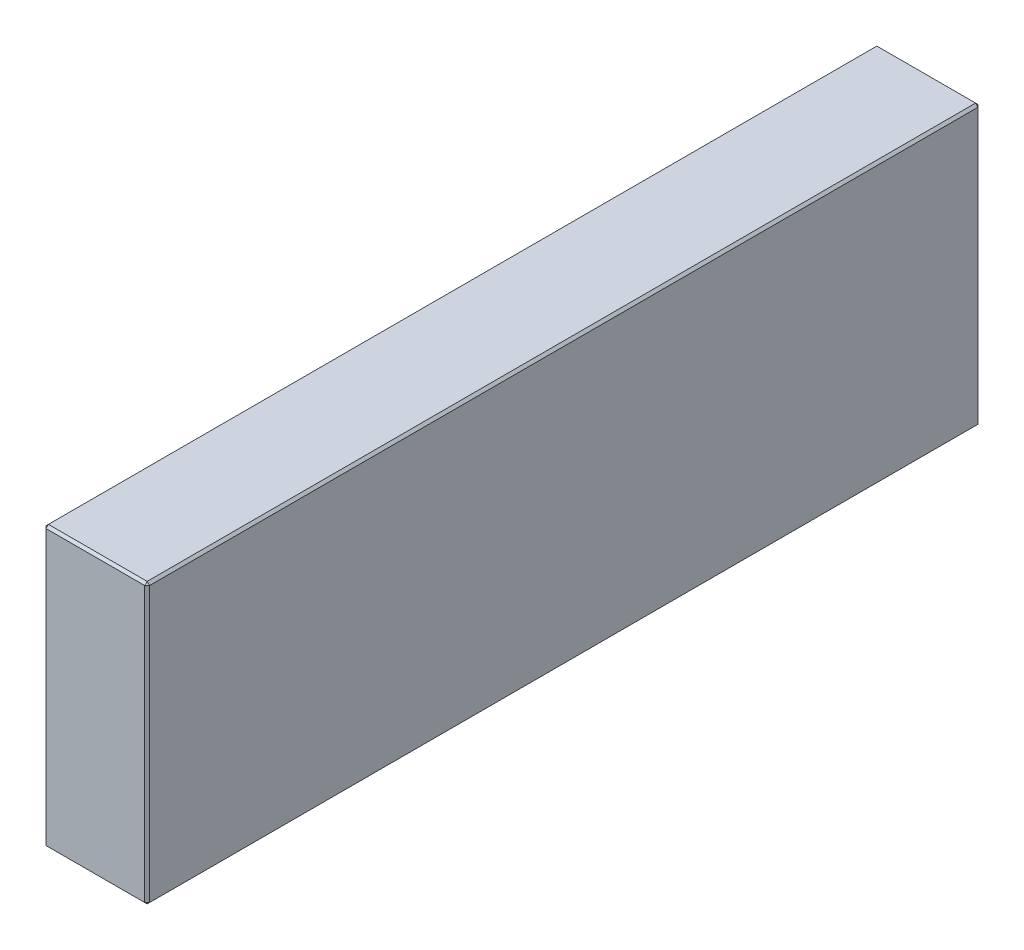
ISO-10303-21;
HEADER;
FILE_DESCRIPTION(('STEP AP214'),'2;1');
FILE_NAME('part.step','',(''),(''),'','','');
FILE_SCHEMA(('AUTOMOTIVE_DESIGN { 1 0 10303 214 1 1 1 1 }'));
ENDSEC;
DATA;
#1=APPLICATION_CONTEXT('core data for automotive mechanical design processes');
#2=APPLICATION_PROTOCOL_DEFINITION('international standard','automotive_design',2000,#1);
#3=PRODUCT_CONTEXT('',#1,'mechanical');
#4=PRODUCT('Part','Part','',(#3));
#5=PRODUCT_RELATED_PRODUCT_CATEGORY('part','',(#4));
#6=PRODUCT_DEFINITION_FORMATION('','',#4);
#7=PRODUCT_DEFINITION_CONTEXT('part definition',#1,'design');
#8=PRODUCT_DEFINITION('design','',#6,#7);
#9=PRODUCT_DEFINITION_SHAPE('','',#8);
#10=(LENGTH_UNIT() NAMED_UNIT(*) SI_UNIT(.MILLI.,.METRE.));
#11=(NAMED_UNIT(*) PLANE_ANGLE_UNIT() SI_UNIT($,.RADIAN.));
#12=(NAMED_UNIT(*) SI_UNIT($,.STERADIAN.) SOLID_ANGLE_UNIT());
#13=UNCERTAINTY_MEASURE_WITH_UNIT(LENGTH_MEASURE(1.E-05),#10,'distance_accuracy_value','');
#14=(GEOMETRIC_REPRESENTATION_CONTEXT(3) GLOBAL_UNCERTAINTY_ASSIGNED_CONTEXT((#13)) GLOBAL_UNIT_ASSIGNED_CONTEXT((#10,
#11,#12)) REPRESENTATION_CONTEXT('',''));
#15=CARTESIAN_POINT('',(0.,0.,0.));
#16=DIRECTION('',(0.,0.,1.));
#17=DIRECTION('',(1.,0.,0.));
#18=AXIS2_PLACEMENT_3D('',#15,#16,#17);
#19=CARTESIAN_POINT('',(-21.5,116.,173.));
#20=DIRECTION('',(1.,0.,0.));
#21=DIRECTION('',(0.,0.,-1.));
#22=AXIS2_PLACEMENT_3D('',#19,#20,#21);
#23=PLANE('',#22);
#24=DIRECTION('',(0.,-1.,0.));
#25=VECTOR('',#24,1.);
#26=CARTESIAN_POINT('',(-21.5,116.,-172.));
#27=LINE('',#26,#25);
#28=CARTESIAN_POINT('',(-21.5,115.,-172.));
#29=VERTEX_POINT('',#28);
#30=CARTESIAN_POINT('',(-21.5,1.,-172.));
#31=VERTEX_POINT('',#30);
#32=EDGE_CURVE('E114',#29,#31,#27,.T.);
#33=ORIENTED_EDGE('',*,*,#32,.T.);
#34=DIRECTION('',(0.,0.,1.));
#35=VECTOR('',#34,1.);
#36=CARTESIAN_POINT('',(-21.5,1.,173.));
#37=LINE('',#36,#35);
#38=CARTESIAN_POINT('',(-21.5,1.,172.));
#39=VERTEX_POINT('',#38);
#40=EDGE_CURVE('E110',#31,#39,#37,.T.);
#41=ORIENTED_EDGE('',*,*,#40,.T.);
#42=DIRECTION('',(0.,1.,0.));
#43=VECTOR('',#42,1.);
#44=CARTESIAN_POINT('',(-21.5,116.,172.));
#45=LINE('',#44,#43);
#46=CARTESIAN_POINT('',(-21.5,115.,172.));
#47=VERTEX_POINT('',#46);
#48=EDGE_CURVE('E103',#39,#47,#45,.T.);
#49=ORIENTED_EDGE('',*,*,#48,.T.);
#50=DIRECTION('',(0.,0.,-1.));
#51=VECTOR('',#50,1.);
#52=CARTESIAN_POINT('',(-21.5,115.,-173.));
#53=LINE('',#52,#51);
#54=EDGE_CURVE('E107',#47,#29,#53,.T.);
#55=ORIENTED_EDGE('',*,*,#54,.T.);
#56=EDGE_LOOP('',(#33,#41,#49,#55));
#57=FACE_BOUND('',#56,.T.);
#58=ADVANCED_FACE('F15',(#57),#23,.F.);
#59=CARTESIAN_POINT('',(21.5,116.,173.));
#60=DIRECTION('',(0.,0.,-1.));
#61=DIRECTION('',(-1.,0.,0.));
#62=AXIS2_PLACEMENT_3D('',#59,#60,#61);
#63=PLANE('',#62);
#64=DIRECTION('',(-1.,0.,0.));
#65=VECTOR('',#64,1.);
#66=CARTESIAN_POINT('',(-21.5,115.,173.));
#67=LINE('',#66,#65);
#68=CARTESIAN_POINT('',(20.5,115.,173.));
#69=VERTEX_POINT('',#68);
#70=CARTESIAN_POINT('',(-20.5,115.,173.));
#71=VERTEX_POINT('',#70);
#72=EDGE_CURVE('E164',#69,#71,#67,.T.);
#73=ORIENTED_EDGE('',*,*,#72,.T.);
#74=DIRECTION('',(0.,-1.,0.));
#75=VECTOR('',#74,1.);
#76=CARTESIAN_POINT('',(-20.5,116.,173.));
#77=LINE('',#76,#75);
#78=CARTESIAN_POINT('',(-20.5,1.,173.));
#79=VERTEX_POINT('',#78);
#80=EDGE_CURVE('E122',#71,#79,#77,.T.);
#81=ORIENTED_EDGE('',*,*,#80,.T.);
#82=DIRECTION('',(1.,0.,0.));
#83=VECTOR('',#82,1.);
#84=CARTESIAN_POINT('',(21.5,1.,173.));
#85=LINE('',#84,#83);
#86=CARTESIAN_POINT('',(20.5,1.,173.));
#87=VERTEX_POINT('',#86);
#88=EDGE_CURVE('E168',#79,#87,#85,.T.);
#89=ORIENTED_EDGE('',*,*,#88,.T.);
#90=DIRECTION('',(0.,1.,0.));
#91=VECTOR('',#90,1.);
#92=CARTESIAN_POINT('',(20.5,116.,173.));
#93=LINE('',#92,#91);
#94=EDGE_CURVE('E166',#87,#69,#93,.T.);
#95=ORIENTED_EDGE('',*,*,#94,.T.);
#96=EDGE_LOOP('',(#73,#81,#89,#95));
#97=FACE_BOUND('',#96,.T.);
#98=ADVANCED_FACE('F275',(#97),#63,.F.);
#99=CARTESIAN_POINT('',(21.5,116.,173.));
#100=DIRECTION('',(-1.,0.,0.));
#101=DIRECTION('',(0.,0.,1.));
#102=AXIS2_PLACEMENT_3D('',#99,#100,#101);
#103=PLANE('',#102);
#104=DIRECTION('',(0.,0.,-1.));
#105=VECTOR('',#104,1.);
#106=CARTESIAN_POINT('',(21.5,1.,173.));
#107=LINE('',#106,#105);
#108=CARTESIAN_POINT('',(21.5,1.,172.));
#109=VERTEX_POINT('',#108);
#110=CARTESIAN_POINT('',(21.5,1.,-172.));
#111=VERTEX_POINT('',#110);
#112=EDGE_CURVE('E159',#109,#111,#107,.T.);
#113=ORIENTED_EDGE('',*,*,#112,.T.);
#114=DIRECTION('',(0.,1.,0.));
#115=VECTOR('',#114,1.);
#116=CARTESIAN_POINT('',(21.5,116.,-172.));
#117=LINE('',#116,#115);
#118=CARTESIAN_POINT('',(21.5,115.,-172.));
#119=VERTEX_POINT('',#118);
#120=EDGE_CURVE('E161',#111,#119,#117,.T.);
#121=ORIENTED_EDGE('',*,*,#120,.T.);
#122=DIRECTION('',(0.,0.,1.));
#123=VECTOR('',#122,1.);
#124=CARTESIAN_POINT('',(21.5,115.,173.));
#125=LINE('',#124,#123);
#126=CARTESIAN_POINT('',(21.5,115.,172.));
#127=VERTEX_POINT('',#126);
#128=EDGE_CURVE('E155',#119,#127,#125,.T.);
#129=ORIENTED_EDGE('',*,*,#128,.T.);
#130=DIRECTION('',(0.,-1.,0.));
#131=VECTOR('',#130,1.);
#132=CARTESIAN_POINT('',(21.5,116.,172.));
#133=LINE('',#132,#131);
#134=EDGE_CURVE('E157',#127,#109,#133,.T.);
#135=ORIENTED_EDGE('',*,*,#134,.T.);
#136=EDGE_LOOP('',(#113,#121,#129,#135));
#137=FACE_BOUND('',#136,.T.);
#138=ADVANCED_FACE('F254',(#137),#103,.F.);
#139=CARTESIAN_POINT('',(21.5,116.,-173.));
#140=DIRECTION('',(0.,0.,1.));
#141=DIRECTION('',(1.,0.,0.));
#142=AXIS2_PLACEMENT_3D('',#139,#140,#141);
#143=PLANE('',#142);
#144=DIRECTION('',(0.,-1.,0.));
#145=VECTOR('',#144,1.);
#146=CARTESIAN_POINT('',(20.5,116.,-173.));
#147=LINE('',#146,#145);
#148=CARTESIAN_POINT('',(20.5,115.,-173.));
#149=VERTEX_POINT('',#148);
#150=CARTESIAN_POINT('',(20.5,1.,-173.));
#151=VERTEX_POINT('',#150);
#152=EDGE_CURVE('E148',#149,#151,#147,.T.);
#153=ORIENTED_EDGE('',*,*,#152,.T.);
#154=DIRECTION('',(-1.,0.,0.));
#155=VECTOR('',#154,1.);
#156=CARTESIAN_POINT('',(21.5,1.,-173.));
#157=LINE('',#156,#155);
#158=CARTESIAN_POINT('',(-20.5,1.,-173.));
#159=VERTEX_POINT('',#158);
#160=EDGE_CURVE('E153',#151,#159,#157,.T.);
#161=ORIENTED_EDGE('',*,*,#160,.T.);
#162=DIRECTION('',(0.,1.,0.));
#163=VECTOR('',#162,1.);
#164=CARTESIAN_POINT('',(-20.5,116.,-173.));
#165=LINE('',#164,#163);
#166=CARTESIAN_POINT('',(-20.5,115.,-173.));
#167=VERTEX_POINT('',#166);
#168=EDGE_CURVE('E150',#159,#167,#165,.T.);
#169=ORIENTED_EDGE('',*,*,#168,.T.);
#170=DIRECTION('',(1.,0.,0.));
#171=VECTOR('',#170,1.);
#172=CARTESIAN_POINT('',(21.5,115.,-173.));
#173=LINE('',#172,#171);
#174=EDGE_CURVE('E146',#167,#149,#173,.T.);
#175=ORIENTED_EDGE('',*,*,#174,.T.);
#176=EDGE_LOOP('',(#153,#161,#169,#175));
#177=FACE_BOUND('',#176,.T.);
#178=ADVANCED_FACE('F284',(#177),#143,.F.);
#179=CARTESIAN_POINT('',(0.,116.,0.));
#180=DIRECTION('',(0.,1.,0.));
#181=DIRECTION('',(0.,0.,1.));
#182=AXIS2_PLACEMENT_3D('',#179,#180,#181);
#183=PLANE('',#182);
#184=DIRECTION('',(0.,0.,-1.));
#185=VECTOR('',#184,1.);
#186=CARTESIAN_POINT('',(20.5,116.,-173.));
#187=LINE('',#186,#185);
#188=CARTESIAN_POINT('',(20.5,116.,172.));
#189=VERTEX_POINT('',#188);
#190=CARTESIAN_POINT('',(20.5,116.,-172.));
#191=VERTEX_POINT('',#190);
#192=EDGE_CURVE('E24',#189,#191,#187,.T.);
#193=ORIENTED_EDGE('',*,*,#192,.T.);
#194=DIRECTION('',(-1.,0.,0.));
#195=VECTOR('',#194,1.);
#196=CARTESIAN_POINT('',(-21.5,116.,-172.));
#197=LINE('',#196,#195);
#198=CARTESIAN_POINT('',(-20.5,116.,-172.));
#199=VERTEX_POINT('',#198);
#200=EDGE_CURVE('E9',#191,#199,#197,.T.);
#201=ORIENTED_EDGE('',*,*,#200,.T.);
#202=DIRECTION('',(0.,0.,1.));
#203=VECTOR('',#202,1.);
#204=CARTESIAN_POINT('',(-20.5,116.,173.));
#205=LINE('',#204,#203);
#206=CARTESIAN_POINT('',(-20.5,116.,172.));
#207=VERTEX_POINT('',#206);
#208=EDGE_CURVE('E180',#199,#207,#205,.T.);
#209=ORIENTED_EDGE('',*,*,#208,.T.);
#210=DIRECTION('',(1.,0.,0.));
#211=VECTOR('',#210,1.);
#212=CARTESIAN_POINT('',(21.5,116.,172.));
#213=LINE('',#212,#211);
#214=EDGE_CURVE('E35',#207,#189,#213,.T.);
#215=ORIENTED_EDGE('',*,*,#214,.T.);
#216=EDGE_LOOP('',(#193,#201,#209,#215));
#217=FACE_BOUND('',#216,.T.);
#218=ADVANCED_FACE('F350',(#217),#183,.T.);
#219=CARTESIAN_POINT('',(0.,0.,0.));
#220=DIRECTION('',(0.,1.,0.));
#221=DIRECTION('',(0.,0.,1.));
#222=AXIS2_PLACEMENT_3D('',#219,#220,#221);
#223=PLANE('',#222);
#224=DIRECTION('',(0.,0.,1.));
#225=VECTOR('',#224,1.);
#226=CARTESIAN_POINT('',(20.5,0.,0.));
#227=LINE('',#226,#225);
#228=CARTESIAN_POINT('',(20.5,0.,-172.));
#229=VERTEX_POINT('',#228);
#230=CARTESIAN_POINT('',(20.5,0.,172.));
#231=VERTEX_POINT('',#230);
#232=EDGE_CURVE('E171',#229,#231,#227,.T.);
#233=ORIENTED_EDGE('',*,*,#232,.T.);
#234=DIRECTION('',(-1.,0.,0.));
#235=VECTOR('',#234,1.);
#236=CARTESIAN_POINT('',(0.,0.,172.));
#237=LINE('',#236,#235);
#238=CARTESIAN_POINT('',(-20.5,0.,172.));
#239=VERTEX_POINT('',#238);
#240=EDGE_CURVE('E177',#231,#239,#237,.T.);
#241=ORIENTED_EDGE('',*,*,#240,.T.);
#242=DIRECTION('',(0.,0.,-1.));
#243=VECTOR('',#242,1.);
#244=CARTESIAN_POINT('',(-20.5,0.,0.));
#245=LINE('',#244,#243);
#246=CARTESIAN_POINT('',(-20.5,0.,-172.));
#247=VERTEX_POINT('',#246);
#248=EDGE_CURVE('E175',#239,#247,#245,.T.);
#249=ORIENTED_EDGE('',*,*,#248,.T.);
#250=DIRECTION('',(1.,0.,0.));
#251=VECTOR('',#250,1.);
#252=CARTESIAN_POINT('',(0.,0.,-172.));
#253=LINE('',#252,#251);
#254=EDGE_CURVE('E173',#247,#229,#253,.T.);
#255=ORIENTED_EDGE('',*,*,#254,.T.);
#256=EDGE_LOOP('',(#233,#241,#249,#255));
#257=FACE_BOUND('',#256,.T.);
#258=ADVANCED_FACE('F246',(#257),#223,.F.);
#259=CARTESIAN_POINT('',(21.5,116.,172.));
#260=DIRECTION('',(-0.707106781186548,0.,-0.707106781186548));
#261=DIRECTION('',(0.,-1.,0.));
#262=AXIS2_PLACEMENT_3D('',#259,#260,#261);
#263=PLANE('',#262);
#264=DIRECTION('',(-0.707106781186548,0.,0.707106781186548));
#265=VECTOR('',#264,1.);
#266=CARTESIAN_POINT('',(20.5,115.,173.));
#267=LINE('',#266,#265);
#268=EDGE_CURVE('E19',#69,#127,#267,.F.);
#269=ORIENTED_EDGE('',*,*,#268,.F.);
#270=ORIENTED_EDGE('',*,*,#94,.F.);
#271=DIRECTION('',(0.707106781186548,0.,-0.707106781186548));
#272=VECTOR('',#271,1.);
#273=CARTESIAN_POINT('',(20.5,1.,173.));
#274=LINE('',#273,#272);
#275=EDGE_CURVE('E142',#109,#87,#274,.F.);
#276=ORIENTED_EDGE('',*,*,#275,.F.);
#277=ORIENTED_EDGE('',*,*,#134,.F.);
#278=EDGE_LOOP('',(#269,#270,#276,#277));
#279=FACE_BOUND('',#278,.T.);
#280=ADVANCED_FACE('F17',(#279),#263,.F.);
#281=CARTESIAN_POINT('',(20.5,115.,173.));
#282=DIRECTION('',(0.577350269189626,0.577350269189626,0.577350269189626));
#283=DIRECTION('',(0.707106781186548,0.,-0.707106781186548));
#284=AXIS2_PLACEMENT_3D('',#281,#282,#283);
#285=PLANE('',#284);
#286=DIRECTION('',(0.,-0.707106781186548,0.707106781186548));
#287=VECTOR('',#286,1.);
#288=CARTESIAN_POINT('',(20.5,115.,173.));
#289=LINE('',#288,#287);
#290=EDGE_CURVE('E226',#69,#189,#289,.F.);
#291=ORIENTED_EDGE('',*,*,#290,.F.);
#292=ORIENTED_EDGE('',*,*,#268,.T.);
#293=DIRECTION('',(-0.707106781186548,0.707106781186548,0.));
#294=VECTOR('',#293,1.);
#295=CARTESIAN_POINT('',(21.,115.5,172.));
#296=LINE('',#295,#294);
#297=EDGE_CURVE('E228',#189,#127,#296,.F.);
#298=ORIENTED_EDGE('',*,*,#297,.F.);
#299=EDGE_LOOP('',(#291,#292,#298));
#300=FACE_BOUND('',#299,.T.);
#301=ADVANCED_FACE('F270',(#300),#285,.T.);
#302=CARTESIAN_POINT('',(20.5,1.,173.));
#303=DIRECTION('',(0.577350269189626,-0.577350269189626,0.577350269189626));
#304=DIRECTION('',(0.707106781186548,0.,-0.707106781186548));
#305=AXIS2_PLACEMENT_3D('',#302,#303,#304);
#306=PLANE('',#305);
#307=DIRECTION('',(-0.707106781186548,-0.707106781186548,0.));
#308=VECTOR('',#307,1.);
#309=CARTESIAN_POINT('',(21.,0.5,172.));
#310=LINE('',#309,#308);
#311=EDGE_CURVE('E220',#109,#231,#310,.T.);
#312=ORIENTED_EDGE('',*,*,#311,.F.);
#313=ORIENTED_EDGE('',*,*,#275,.T.);
#314=DIRECTION('',(0.,0.707106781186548,0.707106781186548));
#315=VECTOR('',#314,1.);
#316=CARTESIAN_POINT('',(20.5,1.,173.));
#317=LINE('',#316,#315);
#318=EDGE_CURVE('E223',#231,#87,#317,.T.);
#319=ORIENTED_EDGE('',*,*,#318,.F.);
#320=EDGE_LOOP('',(#312,#313,#319));
#321=FACE_BOUND('',#320,.T.);
#322=ADVANCED_FACE('F235',(#321),#306,.T.);
#323=CARTESIAN_POINT('',(20.5,116.,0.));
#324=DIRECTION('',(0.707106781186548,0.707106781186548,0.));
#325=DIRECTION('',(0.,0.,1.));
#326=AXIS2_PLACEMENT_3D('',#323,#324,#325);
#327=PLANE('',#326);
#328=ORIENTED_EDGE('',*,*,#297,.T.);
#329=ORIENTED_EDGE('',*,*,#128,.F.);
#330=DIRECTION('',(0.707106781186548,-0.707106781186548,0.));
#331=VECTOR('',#330,1.);
#332=CARTESIAN_POINT('',(21.5,115.,-172.));
#333=LINE('',#332,#331);
#334=EDGE_CURVE('E215',#191,#119,#333,.T.);
#335=ORIENTED_EDGE('',*,*,#334,.F.);
#336=ORIENTED_EDGE('',*,*,#192,.F.);
#337=EDGE_LOOP('',(#328,#329,#335,#336));
#338=FACE_BOUND('',#337,.T.);
#339=ADVANCED_FACE('F265',(#338),#327,.T.);
#340=CARTESIAN_POINT('',(0.,116.,172.));
#341=DIRECTION('',(0.,0.707106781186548,0.707106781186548));
#342=DIRECTION('',(-1.,0.,0.));
#343=AXIS2_PLACEMENT_3D('',#340,#341,#342);
#344=PLANE('',#343);
#345=ORIENTED_EDGE('',*,*,#290,.T.);
#346=ORIENTED_EDGE('',*,*,#214,.F.);
#347=DIRECTION('',(0.,0.707106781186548,-0.707106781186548));
#348=VECTOR('',#347,1.);
#349=CARTESIAN_POINT('',(-20.5,115.5,172.5));
#350=LINE('',#349,#348);
#351=EDGE_CURVE('E126',#71,#207,#350,.T.);
#352=ORIENTED_EDGE('',*,*,#351,.F.);
#353=ORIENTED_EDGE('',*,*,#72,.F.);
#354=EDGE_LOOP('',(#345,#346,#352,#353));
#355=FACE_BOUND('',#354,.T.);
#356=ADVANCED_FACE('F273',(#355),#344,.T.);
#357=CARTESIAN_POINT('',(-20.5,116.,173.));
#358=DIRECTION('',(0.707106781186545,0.,-0.70710678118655));
#359=DIRECTION('',(0.,-1.,0.));
#360=AXIS2_PLACEMENT_3D('',#357,#358,#359);
#361=PLANE('',#360);
#362=DIRECTION('',(0.70710678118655,0.,0.707106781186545));
#363=VECTOR('',#362,1.);
#364=CARTESIAN_POINT('',(-20.5,1.,173.));
#365=LINE('',#364,#363);
#366=EDGE_CURVE('E127',#79,#39,#365,.F.);
#367=ORIENTED_EDGE('',*,*,#366,.F.);
#368=ORIENTED_EDGE('',*,*,#80,.F.);
#369=DIRECTION('',(-0.70710678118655,0.,-0.707106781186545));
#370=VECTOR('',#369,1.);
#371=CARTESIAN_POINT('',(-21.5,115.,172.));
#372=LINE('',#371,#370);
#373=EDGE_CURVE('E118',#47,#71,#372,.F.);
#374=ORIENTED_EDGE('',*,*,#373,.F.);
#375=ORIENTED_EDGE('',*,*,#48,.F.);
#376=EDGE_LOOP('',(#367,#368,#374,#375));
#377=FACE_BOUND('',#376,.T.);
#378=ADVANCED_FACE('F120',(#377),#361,.F.);
#379=CARTESIAN_POINT('',(21.5,1.,173.));
#380=DIRECTION('',(0.,0.707106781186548,-0.707106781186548));
#381=DIRECTION('',(1.,0.,0.));
#382=AXIS2_PLACEMENT_3D('',#379,#380,#381);
#383=PLANE('',#382);
#384=ORIENTED_EDGE('',*,*,#318,.T.);
#385=ORIENTED_EDGE('',*,*,#88,.F.);
#386=DIRECTION('',(0.,-0.707106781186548,-0.707106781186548));
#387=VECTOR('',#386,1.);
#388=CARTESIAN_POINT('',(-20.5,1.,173.));
#389=LINE('',#388,#387);
#390=EDGE_CURVE('E211',#239,#79,#389,.F.);
#391=ORIENTED_EDGE('',*,*,#390,.F.);
#392=ORIENTED_EDGE('',*,*,#240,.F.);
#393=EDGE_LOOP('',(#384,#385,#391,#392));
#394=FACE_BOUND('',#393,.T.);
#395=ADVANCED_FACE('F243',(#394),#383,.F.);
#396=CARTESIAN_POINT('',(21.5,1.,173.));
#397=DIRECTION('',(-0.707106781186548,0.707106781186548,0.));
#398=DIRECTION('',(0.,0.,-1.));
#399=AXIS2_PLACEMENT_3D('',#396,#397,#398);
#400=PLANE('',#399);
#401=ORIENTED_EDGE('',*,*,#311,.T.);
#402=ORIENTED_EDGE('',*,*,#232,.F.);
#403=DIRECTION('',(0.707106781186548,0.707106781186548,0.));
#404=VECTOR('',#403,1.);
#405=CARTESIAN_POINT('',(21.,0.499999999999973,-172.));
#406=LINE('',#405,#404);
#407=EDGE_CURVE('E208',#111,#229,#406,.F.);
#408=ORIENTED_EDGE('',*,*,#407,.F.);
#409=ORIENTED_EDGE('',*,*,#112,.F.);
#410=EDGE_LOOP('',(#401,#402,#408,#409));
#411=FACE_BOUND('',#410,.T.);
#412=ADVANCED_FACE('F251',(#411),#400,.F.);
#413=CARTESIAN_POINT('',(20.5,116.,-173.));
#414=DIRECTION('',(-0.707106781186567,0.,0.707106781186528));
#415=DIRECTION('',(0.,-1.,0.));
#416=AXIS2_PLACEMENT_3D('',#413,#414,#415);
#417=PLANE('',#416);
#418=DIRECTION('',(0.707106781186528,0.,0.707106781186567));
#419=VECTOR('',#418,1.);
#420=CARTESIAN_POINT('',(21.5,115.,-172.));
#421=LINE('',#420,#419);
#422=EDGE_CURVE('E217',#119,#149,#421,.F.);
#423=ORIENTED_EDGE('',*,*,#422,.F.);
#424=ORIENTED_EDGE('',*,*,#120,.F.);
#425=DIRECTION('',(-0.707106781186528,0.,-0.707106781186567));
#426=VECTOR('',#425,1.);
#427=CARTESIAN_POINT('',(20.5,1.,-173.));
#428=LINE('',#427,#426);
#429=EDGE_CURVE('E205',#151,#111,#428,.F.);
#430=ORIENTED_EDGE('',*,*,#429,.F.);
#431=ORIENTED_EDGE('',*,*,#152,.F.);
#432=EDGE_LOOP('',(#423,#424,#430,#431));
#433=FACE_BOUND('',#432,.T.);
#434=ADVANCED_FACE('F258',(#433),#417,.F.);
#435=CARTESIAN_POINT('',(21.5,115.,-172.));
#436=DIRECTION('',(0.577350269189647,0.577350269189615,-0.577350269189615));
#437=DIRECTION('',(-0.707106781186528,0.,-0.707106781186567));
#438=AXIS2_PLACEMENT_3D('',#435,#436,#437);
#439=PLANE('',#438);
#440=ORIENTED_EDGE('',*,*,#334,.T.);
#441=ORIENTED_EDGE('',*,*,#422,.T.);
#442=DIRECTION('',(0.,0.707106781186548,0.707106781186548));
#443=VECTOR('',#442,1.);
#444=CARTESIAN_POINT('',(20.5,115.5,-172.5));
#445=LINE('',#444,#443);
#446=EDGE_CURVE('E134',#191,#149,#445,.F.);
#447=ORIENTED_EDGE('',*,*,#446,.F.);
#448=EDGE_LOOP('',(#440,#441,#447));
#449=FACE_BOUND('',#448,.T.);
#450=ADVANCED_FACE('F325',(#449),#439,.T.);
#451=CARTESIAN_POINT('',(-21.5,115.,172.));
#452=DIRECTION('',(-0.577350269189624,0.577350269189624,0.577350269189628));
#453=DIRECTION('',(0.70710678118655,0.,0.707106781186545));
#454=AXIS2_PLACEMENT_3D('',#451,#452,#453);
#455=PLANE('',#454);
#456=ORIENTED_EDGE('',*,*,#373,.T.);
#457=ORIENTED_EDGE('',*,*,#351,.T.);
#458=DIRECTION('',(-0.707106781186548,-0.707106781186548,0.));
#459=VECTOR('',#458,1.);
#460=CARTESIAN_POINT('',(-21.5,115.,172.));
#461=LINE('',#460,#459);
#462=EDGE_CURVE('E130',#47,#207,#461,.F.);
#463=ORIENTED_EDGE('',*,*,#462,.F.);
#464=EDGE_LOOP('',(#456,#457,#463));
#465=FACE_BOUND('',#464,.T.);
#466=ADVANCED_FACE('F131',(#465),#455,.T.);
#467=CARTESIAN_POINT('',(-20.5,1.,173.));
#468=DIRECTION('',(-0.577350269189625,-0.577350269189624,0.577350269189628));
#469=DIRECTION('',(0.70710678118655,0.,0.707106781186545));
#470=AXIS2_PLACEMENT_3D('',#467,#468,#469);
#471=PLANE('',#470);
#472=ORIENTED_EDGE('',*,*,#390,.T.);
#473=ORIENTED_EDGE('',*,*,#366,.T.);
#474=DIRECTION('',(-0.707106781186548,0.707106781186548,0.));
#475=VECTOR('',#474,1.);
#476=CARTESIAN_POINT('',(-21.,0.5,172.));
#477=LINE('',#476,#475);
#478=EDGE_CURVE('E135',#239,#39,#477,.T.);
#479=ORIENTED_EDGE('',*,*,#478,.F.);
#480=EDGE_LOOP('',(#472,#473,#479));
#481=FACE_BOUND('',#480,.T.);
#482=ADVANCED_FACE('F318',(#481),#471,.T.);
#483=CARTESIAN_POINT('',(20.5,1.,-173.));
#484=DIRECTION('',(0.577350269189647,-0.577350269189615,-0.577350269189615));
#485=DIRECTION('',(-0.707106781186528,0.,-0.707106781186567));
#486=AXIS2_PLACEMENT_3D('',#483,#484,#485);
#487=PLANE('',#486);
#488=ORIENTED_EDGE('',*,*,#429,.T.);
#489=ORIENTED_EDGE('',*,*,#407,.T.);
#490=DIRECTION('',(0.,-0.707106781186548,0.707106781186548));
#491=VECTOR('',#490,1.);
#492=CARTESIAN_POINT('',(20.5,1.,-173.));
#493=LINE('',#492,#491);
#494=EDGE_CURVE('E198',#151,#229,#493,.T.);
#495=ORIENTED_EDGE('',*,*,#494,.F.);
#496=EDGE_LOOP('',(#488,#489,#495));
#497=FACE_BOUND('',#496,.T.);
#498=ADVANCED_FACE('F314',(#497),#487,.T.);
#499=CARTESIAN_POINT('',(0.,116.,-172.));
#500=DIRECTION('',(0.,0.707106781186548,-0.707106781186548));
#501=DIRECTION('',(1.,0.,0.));
#502=AXIS2_PLACEMENT_3D('',#499,#500,#501);
#503=PLANE('',#502);
#504=ORIENTED_EDGE('',*,*,#446,.T.);
#505=ORIENTED_EDGE('',*,*,#174,.F.);
#506=DIRECTION('',(0.,-0.707106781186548,-0.707106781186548));
#507=VECTOR('',#506,1.);
#508=CARTESIAN_POINT('',(-20.5,115.,-173.));
#509=LINE('',#508,#507);
#510=EDGE_CURVE('E195',#199,#167,#509,.T.);
#511=ORIENTED_EDGE('',*,*,#510,.F.);
#512=ORIENTED_EDGE('',*,*,#200,.F.);
#513=EDGE_LOOP('',(#504,#505,#511,#512));
#514=FACE_BOUND('',#513,.T.);
#515=ADVANCED_FACE('F311',(#514),#503,.T.);
#516=CARTESIAN_POINT('',(-20.5,116.,0.));
#517=DIRECTION('',(-0.707106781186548,0.707106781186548,0.));
#518=DIRECTION('',(0.,0.,-1.));
#519=AXIS2_PLACEMENT_3D('',#516,#517,#518);
#520=PLANE('',#519);
#521=ORIENTED_EDGE('',*,*,#462,.T.);
#522=ORIENTED_EDGE('',*,*,#208,.F.);
#523=DIRECTION('',(0.707106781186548,0.707106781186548,0.));
#524=VECTOR('',#523,1.);
#525=CARTESIAN_POINT('',(-21.,115.5,-172.));
#526=LINE('',#525,#524);
#527=EDGE_CURVE('E138',#29,#199,#526,.T.);
#528=ORIENTED_EDGE('',*,*,#527,.F.);
#529=ORIENTED_EDGE('',*,*,#54,.F.);
#530=EDGE_LOOP('',(#521,#522,#528,#529));
#531=FACE_BOUND('',#530,.T.);
#532=ADVANCED_FACE('F137',(#531),#520,.T.);
#533=CARTESIAN_POINT('',(-21.5,1.,173.));
#534=DIRECTION('',(0.707106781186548,0.707106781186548,0.));
#535=DIRECTION('',(0.,0.,1.));
#536=AXIS2_PLACEMENT_3D('',#533,#534,#535);
#537=PLANE('',#536);
#538=ORIENTED_EDGE('',*,*,#478,.T.);
#539=ORIENTED_EDGE('',*,*,#40,.F.);
#540=DIRECTION('',(0.707106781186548,-0.707106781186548,0.));
#541=VECTOR('',#540,1.);
#542=CARTESIAN_POINT('',(-21.5,1.,-172.));
#543=LINE('',#542,#541);
#544=EDGE_CURVE('E191',#247,#31,#543,.F.);
#545=ORIENTED_EDGE('',*,*,#544,.F.);
#546=ORIENTED_EDGE('',*,*,#248,.F.);
#547=EDGE_LOOP('',(#538,#539,#545,#546));
#548=FACE_BOUND('',#547,.T.);
#549=ADVANCED_FACE('F304',(#548),#537,.F.);
#550=CARTESIAN_POINT('',(21.5,1.,-173.));
#551=DIRECTION('',(0.,0.707106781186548,0.707106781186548));
#552=DIRECTION('',(-1.,0.,0.));
#553=AXIS2_PLACEMENT_3D('',#550,#551,#552);
#554=PLANE('',#553);
#555=ORIENTED_EDGE('',*,*,#494,.T.);
#556=ORIENTED_EDGE('',*,*,#254,.F.);
#557=DIRECTION('',(0.,0.707106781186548,-0.707106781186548));
#558=VECTOR('',#557,1.);
#559=CARTESIAN_POINT('',(-20.5,0.499999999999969,-172.5));
#560=LINE('',#559,#558);
#561=EDGE_CURVE('E188',#159,#247,#560,.F.);
#562=ORIENTED_EDGE('',*,*,#561,.F.);
#563=ORIENTED_EDGE('',*,*,#160,.F.);
#564=EDGE_LOOP('',(#555,#556,#562,#563));
#565=FACE_BOUND('',#564,.T.);
#566=ADVANCED_FACE('F300',(#565),#554,.F.);
#567=CARTESIAN_POINT('',(-20.5,115.,-173.));
#568=DIRECTION('',(-0.577350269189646,0.577350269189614,-0.577350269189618));
#569=DIRECTION('',(-0.70710678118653,0.,0.707106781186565));
#570=AXIS2_PLACEMENT_3D('',#567,#568,#569);
#571=PLANE('',#570);
#572=ORIENTED_EDGE('',*,*,#527,.T.);
#573=ORIENTED_EDGE('',*,*,#510,.T.);
#574=DIRECTION('',(0.70710678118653,0.,-0.707106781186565));
#575=VECTOR('',#574,1.);
#576=CARTESIAN_POINT('',(-20.5,115.,-173.));
#577=LINE('',#576,#575);
#578=EDGE_CURVE('E186',#29,#167,#577,.T.);
#579=ORIENTED_EDGE('',*,*,#578,.F.);
#580=EDGE_LOOP('',(#572,#573,#579));
#581=FACE_BOUND('',#580,.T.);
#582=ADVANCED_FACE('F296',(#581),#571,.T.);
#583=CARTESIAN_POINT('',(-21.5,1.,-172.));
#584=DIRECTION('',(-0.577350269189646,-0.577350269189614,-0.577350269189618));
#585=DIRECTION('',(-0.70710678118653,0.,0.707106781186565));
#586=AXIS2_PLACEMENT_3D('',#583,#584,#585);
#587=PLANE('',#586);
#588=ORIENTED_EDGE('',*,*,#561,.T.);
#589=ORIENTED_EDGE('',*,*,#544,.T.);
#590=DIRECTION('',(-0.70710678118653,0.,0.707106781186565));
#591=VECTOR('',#590,1.);
#592=CARTESIAN_POINT('',(-21.5,1.,-172.));
#593=LINE('',#592,#591);
#594=EDGE_CURVE('E184',#159,#31,#593,.T.);
#595=ORIENTED_EDGE('',*,*,#594,.F.);
#596=EDGE_LOOP('',(#588,#589,#595));
#597=FACE_BOUND('',#596,.T.);
#598=ADVANCED_FACE('F292',(#597),#587,.T.);
#599=CARTESIAN_POINT('',(-21.5,116.,-172.));
#600=DIRECTION('',(0.707106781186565,0.,0.707106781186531));
#601=DIRECTION('',(0.,-1.,0.));
#602=AXIS2_PLACEMENT_3D('',#599,#600,#601);
#603=PLANE('',#602);
#604=ORIENTED_EDGE('',*,*,#578,.T.);
#605=ORIENTED_EDGE('',*,*,#168,.F.);
#606=ORIENTED_EDGE('',*,*,#594,.T.);
#607=ORIENTED_EDGE('',*,*,#32,.F.);
#608=EDGE_LOOP('',(#604,#605,#606,#607));
#609=FACE_BOUND('',#608,.T.);
#610=ADVANCED_FACE('F289',(#609),#603,.F.);
#611=CLOSED_SHELL('',(#58,#98,#138,#178,#218,#258,#280,#301,#322,#339,#356,#378,#395,#412,#434,
#450,#466,#482,#498,#515,#532,#549,#566,#582,#598,#610));
#612=MANIFOLD_SOLID_BREP('B1',#611);
#613=ADVANCED_BREP_SHAPE_REPRESENTATION('',(#18,#612),#14);
#614=SHAPE_DEFINITION_REPRESENTATION(#9,#613);
ENDSEC;
END-ISO-10303-21;
